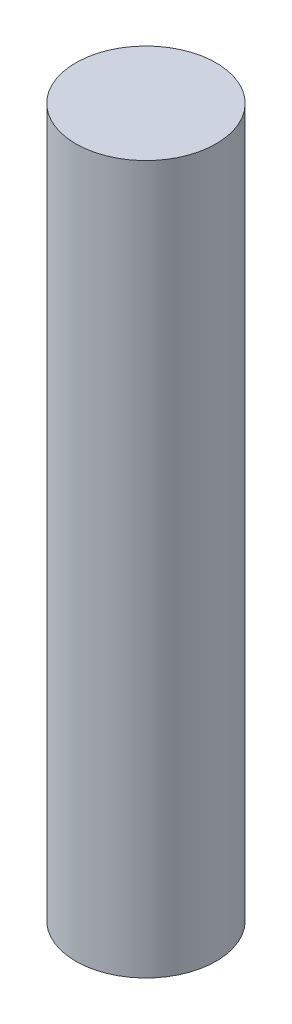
from build123d import *

# Parameters (mm, degrees)
SKETCH1_R           = 0.58
BOSS_EXTRUDE1_DEPTH = 5.85


with BuildPart() as part:
    # Sketch1 → Boss-Extrude1 (new body)
    with BuildSketch(Plane(origin=(0, 0, 0), x_dir=(1, 0, 0), z_dir=(0, 1, 0))):
        with Locations(Location((0, 0, 0), (0, 0, 270))):
            Circle(SKETCH1_R)
    extrude(amount=BOSS_EXTRUDE1_DEPTH)


solid = part.part
